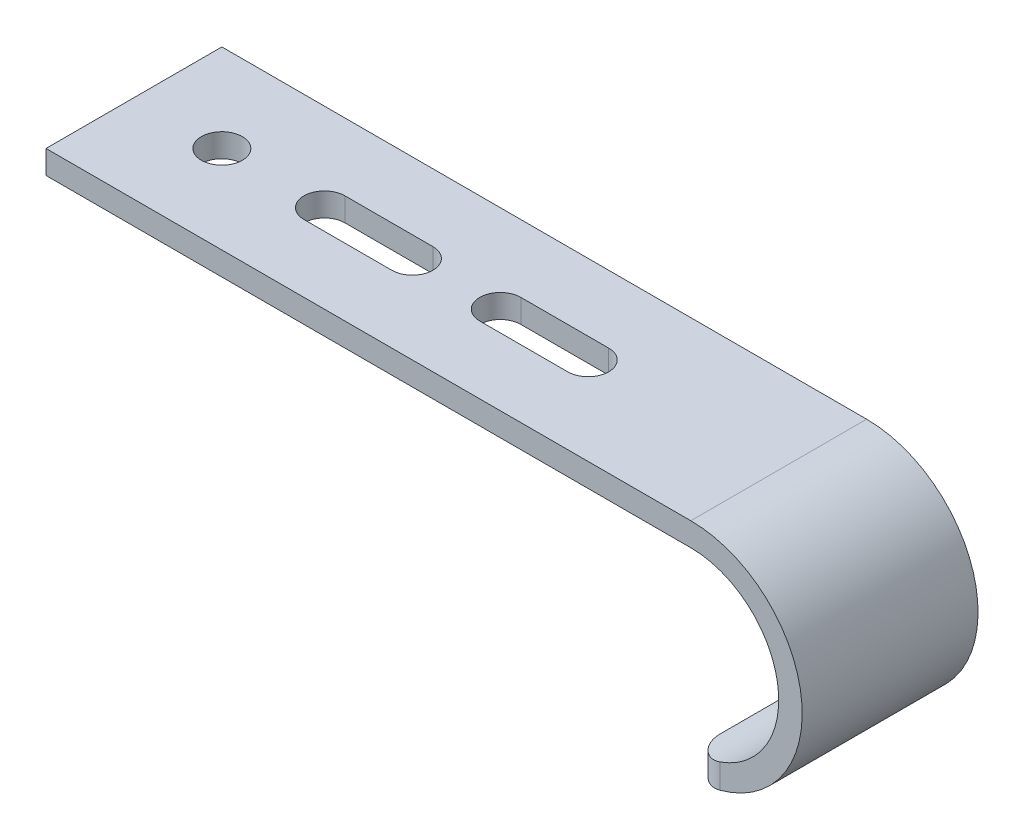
ISO-10303-21;
HEADER;
FILE_DESCRIPTION(('STEP AP214'),'2;1');
FILE_NAME('part.step','',(''),(''),'','','');
FILE_SCHEMA(('AUTOMOTIVE_DESIGN { 1 0 10303 214 1 1 1 1 }'));
ENDSEC;
DATA;
#1=APPLICATION_CONTEXT('core data for automotive mechanical design processes');
#2=APPLICATION_PROTOCOL_DEFINITION('international standard','automotive_design',2000,#1);
#3=PRODUCT_CONTEXT('',#1,'mechanical');
#4=PRODUCT('Part','Part','',(#3));
#5=PRODUCT_RELATED_PRODUCT_CATEGORY('part','',(#4));
#6=PRODUCT_DEFINITION_FORMATION('','',#4);
#7=PRODUCT_DEFINITION_CONTEXT('part definition',#1,'design');
#8=PRODUCT_DEFINITION('design','',#6,#7);
#9=PRODUCT_DEFINITION_SHAPE('','',#8);
#10=(LENGTH_UNIT() NAMED_UNIT(*) SI_UNIT(.MILLI.,.METRE.));
#11=(NAMED_UNIT(*) PLANE_ANGLE_UNIT() SI_UNIT($,.RADIAN.));
#12=(NAMED_UNIT(*) SI_UNIT($,.STERADIAN.) SOLID_ANGLE_UNIT());
#13=UNCERTAINTY_MEASURE_WITH_UNIT(LENGTH_MEASURE(1.E-05),#10,'distance_accuracy_value','');
#14=(GEOMETRIC_REPRESENTATION_CONTEXT(3) GLOBAL_UNCERTAINTY_ASSIGNED_CONTEXT((#13)) GLOBAL_UNIT_ASSIGNED_CONTEXT((#10,
#11,#12)) REPRESENTATION_CONTEXT('',''));
#15=CARTESIAN_POINT('',(0.,0.,0.));
#16=DIRECTION('',(0.,0.,1.));
#17=DIRECTION('',(1.,0.,0.));
#18=AXIS2_PLACEMENT_3D('',#15,#16,#17);
#19=CARTESIAN_POINT('',(0.,0.,15.));
#20=DIRECTION('',(0.,0.,-1.));
#21=DIRECTION('',(-1.,0.,0.));
#22=AXIS2_PLACEMENT_3D('',#19,#20,#21);
#23=CYLINDRICAL_SURFACE('',#22,15.);
#24=CARTESIAN_POINT('',(0.,-15.,-10.));
#25=CARTESIAN_POINT('',(-1.50557723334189E-05,-14.9999851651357,-10.140475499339));
#26=CARTESIAN_POINT('',(0.00591937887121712,-14.9999995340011,-10.2809488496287));
#27=CARTESIAN_POINT('',(0.0295785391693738,-14.999979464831,-10.5608933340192));
#28=CARTESIAN_POINT('',(0.0473027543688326,-14.9999450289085,-10.7003645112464));
#29=CARTESIAN_POINT('',(0.0944196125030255,-14.9997202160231,-10.9772415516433));
#30=CARTESIAN_POINT('',(0.123805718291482,-14.9995299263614,-11.1146485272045));
#31=CARTESIAN_POINT('',(0.194032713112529,-14.9987863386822,-11.3865006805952));
#32=CARTESIAN_POINT('',(0.23487346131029,-14.9982330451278,-11.5209458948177));
#33=CARTESIAN_POINT('',(0.327737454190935,-14.9964909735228,-11.7859691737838));
#34=CARTESIAN_POINT('',(0.379764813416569,-14.995301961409,-11.9165457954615));
#35=CARTESIAN_POINT('',(0.494640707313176,-14.9919522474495,-12.1728949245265));
#36=CARTESIAN_POINT('',(0.557493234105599,-14.9897911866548,-12.2986656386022));
#37=CARTESIAN_POINT('',(0.693514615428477,-14.9841137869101,-12.5443846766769));
#38=CARTESIAN_POINT('',(0.766678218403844,-14.9805981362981,-12.6643359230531));
#39=CARTESIAN_POINT('',(0.922831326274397,-14.9717900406,-12.8976554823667));
#40=CARTESIAN_POINT('',(1.00582419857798,-14.9664969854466,-13.0110215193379));
#41=CARTESIAN_POINT('',(1.18056744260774,-14.9537251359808,-13.2297736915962));
#42=CARTESIAN_POINT('',(1.27227417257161,-14.9462568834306,-13.3351952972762));
#43=CARTESIAN_POINT('',(1.46406398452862,-14.9286900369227,-13.5378838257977));
#44=CARTESIAN_POINT('',(1.56414690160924,-14.9185914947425,-13.6351509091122));
#45=CARTESIAN_POINT('',(1.77188640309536,-14.8953462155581,-13.8208230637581));
#46=CARTESIAN_POINT('',(1.87954266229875,-14.8821996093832,-13.9092285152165));
#47=CARTESIAN_POINT('',(2.10150580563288,-14.8524813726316,-14.0765226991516));
#48=CARTESIAN_POINT('',(2.21581018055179,-14.835911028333,-14.1554149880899));
#49=CARTESIAN_POINT('',(2.4479722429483,-14.7993574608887,-14.3018179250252));
#50=CARTESIAN_POINT('',(2.56572501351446,-14.7794430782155,-14.3695121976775));
#51=CARTESIAN_POINT('',(2.80572920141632,-14.7357645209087,-14.4948300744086));
#52=CARTESIAN_POINT('',(2.92797896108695,-14.7120017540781,-14.5524573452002));
#53=CARTESIAN_POINT('',(3.17606717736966,-14.6604448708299,-14.6574038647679));
#54=CARTESIAN_POINT('',(3.30190705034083,-14.6326491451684,-14.7047189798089));
#55=CARTESIAN_POINT('',(3.55605239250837,-14.5729734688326,-14.7888357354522));
#56=CARTESIAN_POINT('',(3.68435746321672,-14.5410941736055,-14.8256390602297));
#57=CARTESIAN_POINT('',(4.01013574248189,-14.4554497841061,-14.9052102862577));
#58=CARTESIAN_POINT('',(4.2086597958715,-14.3989634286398,-14.941016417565));
#59=CARTESIAN_POINT('',(4.50616131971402,-14.3075265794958,-14.9765565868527));
#60=CARTESIAN_POINT('',(4.60521253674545,-14.275953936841,-14.9853753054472));
#61=CARTESIAN_POINT('',(4.80295501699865,-14.2106461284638,-14.9970960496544));
#62=CARTESIAN_POINT('',(4.90164627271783,-14.1769109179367,-14.9999979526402));
#63=CARTESIAN_POINT('',(4.99999999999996,-14.142135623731,-15.));
#64=B_SPLINE_CURVE_WITH_KNOTS('',3,(#24,#25,#26,#27,#28,#29,#30,#31,#32,#33,#34,#35,#36,#37,#38,
#39,#40,#41,#42,#43,#44,#45,#46,#47,#48,#49,#50,#51,#52,#53,#54,#55,#56,#57,#58,#59,#60,#61,#62,
#63),.UNSPECIFIED.,.F.,.F.,(4,2,2,2,2,2,2,2,2,2,2,2,2,2,2,2,2,2,2,4),(0.,0.421298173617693,
0.842578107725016,1.26362222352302,1.68466116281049,2.10585522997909,2.52720495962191,
2.94834086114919,3.36962145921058,3.7888934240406,4.20815713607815,4.62740285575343,
5.04649135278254,5.45782348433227,5.86900548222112,6.28035200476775,6.69163258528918,
7.31819571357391,7.63104404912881,7.94389886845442),.UNSPECIFIED.);
#65=CARTESIAN_POINT('',(0.,-15.,-10.));
#66=VERTEX_POINT('',#65);
#67=CARTESIAN_POINT('',(4.99999999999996,-14.142135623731,-15.));
#68=VERTEX_POINT('',#67);
#69=EDGE_CURVE('E28',#66,#68,#64,.T.);
#70=ORIENTED_EDGE('',*,*,#69,.F.);
#71=DIRECTION('',(0.,0.,1.));
#72=VECTOR('',#71,1.);
#73=CARTESIAN_POINT('',(0.,-15.,14.9999999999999));
#74=LINE('',#73,#72);
#75=CARTESIAN_POINT('',(0.,-15.,10.0000000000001));
#76=VERTEX_POINT('',#75);
#77=EDGE_CURVE('E141',#76,#66,#74,.F.);
#78=ORIENTED_EDGE('',*,*,#77,.F.);
#79=CARTESIAN_POINT('',(5.00000000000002,-14.142135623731,15.));
#80=CARTESIAN_POINT('',(4.86810448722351,-14.1887864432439,15.0000160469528));
#81=CARTESIAN_POINT('',(4.7355252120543,-14.2335662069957,14.9947811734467));
#82=CARTESIAN_POINT('',(4.46991285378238,-14.3191904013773,14.9736024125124));
#83=CARTESIAN_POINT('',(4.33687965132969,-14.3600336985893,14.9576554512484));
#84=CARTESIAN_POINT('',(4.07133630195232,-14.4375687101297,14.9148428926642));
#85=CARTESIAN_POINT('',(3.93882621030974,-14.4742599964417,14.8879761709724));
#86=CARTESIAN_POINT('',(3.67540012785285,-14.5433821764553,14.8232587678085));
#87=CARTESIAN_POINT('',(3.54448394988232,-14.5758135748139,14.7854093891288));
#88=CARTESIAN_POINT('',(3.2850367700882,-14.6364723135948,14.6986857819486));
#89=CARTESIAN_POINT('',(3.1565112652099,-14.6646908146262,14.6497888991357));
#90=CARTESIAN_POINT('',(2.90317267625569,-14.7169400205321,14.5411800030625));
#91=CARTESIAN_POINT('',(2.77836100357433,-14.7409691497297,14.4814639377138));
#92=CARTESIAN_POINT('',(2.53371666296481,-14.7849826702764,14.3516207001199));
#93=CARTESIAN_POINT('',(2.41387854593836,-14.8049715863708,14.2815053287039));
#94=CARTESIAN_POINT('',(2.18001781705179,-14.8412105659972,14.1312257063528));
#95=CARTESIAN_POINT('',(2.06599736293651,-14.8574592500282,14.0510577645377));
#96=CARTESIAN_POINT('',(1.84791998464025,-14.8861326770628,13.8836516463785));
#97=CARTESIAN_POINT('',(1.74367235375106,-14.8986526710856,13.7966779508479));
#98=CARTESIAN_POINT('',(1.54239889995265,-14.9208331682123,13.6143382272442));
#99=CARTESIAN_POINT('',(1.44537570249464,-14.9304926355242,13.5189691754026));
#100=CARTESIAN_POINT('',(1.25932691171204,-14.9473349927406,13.3205217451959));
#101=CARTESIAN_POINT('',(1.1703014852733,-14.9545178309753,13.2174432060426));
#102=CARTESIAN_POINT('',(1.00087326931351,-14.9668123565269,13.0042523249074));
#103=CARTESIAN_POINT('',(0.920473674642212,-14.9719232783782,12.894137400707));
#104=CARTESIAN_POINT('',(0.768136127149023,-14.98051564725,12.6665095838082));
#105=CARTESIAN_POINT('',(0.696292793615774,-14.9839799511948,12.5489327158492));
#106=CARTESIAN_POINT('',(0.562516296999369,-14.989598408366,12.3081838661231));
#107=CARTESIAN_POINT('',(0.500587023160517,-14.991752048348,12.1850097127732));
#108=CARTESIAN_POINT('',(0.387141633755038,-14.9951107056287,11.9340327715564));
#109=CARTESIAN_POINT('',(0.33561874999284,-14.9963163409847,11.8062330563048));
#110=CARTESIAN_POINT('',(0.243282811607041,-14.9980976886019,11.5468109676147));
#111=CARTESIAN_POINT('',(0.202472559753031,-14.9986732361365,11.4151876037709));
#112=CARTESIAN_POINT('',(0.111746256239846,-14.999688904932,11.0731310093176));
#113=CARTESIAN_POINT('',(0.0698676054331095,-14.9998655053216,10.8604805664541));
#114=CARTESIAN_POINT('',(0.0279667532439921,-14.9999793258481,10.5390645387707));
#115=CARTESIAN_POINT('',(0.017485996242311,-14.9999920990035,10.4315416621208));
#116=CARTESIAN_POINT('',(0.00350320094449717,-15.0000005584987,10.2160256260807));
#117=CARTESIAN_POINT('',(2.28500579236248E-06,-14.9999962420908,10.108032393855));
#118=CARTESIAN_POINT('',(0.,-15.,10.0000000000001));
#119=B_SPLINE_CURVE_WITH_KNOTS('',3,(#79,#80,#81,#82,#83,#84,#85,#86,#87,#88,#89,#90,#91,#92,
#93,#94,#95,#96,#97,#98,#99,#100,#101,#102,#103,#104,#105,#106,#107,#108,#109,#110,#111,#112,
#113,#114,#115,#116,#117,#118),.UNSPECIFIED.,.F.,.F.,(4,2,2,2,2,2,2,2,2,2,2,2,2,2,2,2,2,2,2,4),
(0.,0.419626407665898,0.839373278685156,1.25916338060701,1.67890370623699,2.09951270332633,
2.52027955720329,2.94057253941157,3.36102028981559,3.7695625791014,4.17825262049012,
4.58695118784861,4.9958006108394,5.40881810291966,5.82199722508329,6.2349067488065,
6.64792419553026,7.29601308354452,7.61992335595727,7.94388570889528),.UNSPECIFIED.);
#120=CARTESIAN_POINT('',(5.00000000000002,-14.142135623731,15.));
#121=VERTEX_POINT('',#120);
#122=EDGE_CURVE('E162',#121,#76,#119,.T.);
#123=ORIENTED_EDGE('',*,*,#122,.F.);
#124=CARTESIAN_POINT('',(0.,0.,15.));
#125=DIRECTION('',(0.,0.,-1.));
#126=DIRECTION('',(-1.,0.,0.));
#127=AXIS2_PLACEMENT_3D('',#124,#125,#126);
#128=CIRCLE('',#127,15.);
#129=CARTESIAN_POINT('',(0.,15.,14.9999999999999));
#130=VERTEX_POINT('',#129);
#131=EDGE_CURVE('E165',#130,#121,#128,.T.);
#132=ORIENTED_EDGE('',*,*,#131,.F.);
#133=DIRECTION('',(0.,0.,1.));
#134=VECTOR('',#133,1.);
#135=CARTESIAN_POINT('',(0.,15.,14.9999999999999));
#136=LINE('',#135,#134);
#137=CARTESIAN_POINT('',(0.,15.,-15.));
#138=VERTEX_POINT('',#137);
#139=EDGE_CURVE('E235',#138,#130,#136,.T.);
#140=ORIENTED_EDGE('',*,*,#139,.F.);
#141=CARTESIAN_POINT('',(0.,0.,-15.));
#142=DIRECTION('',(0.,0.,-1.));
#143=DIRECTION('',(-1.,0.,0.));
#144=AXIS2_PLACEMENT_3D('',#141,#142,#143);
#145=CIRCLE('',#144,15.);
#146=EDGE_CURVE('E161',#68,#138,#145,.F.);
#147=ORIENTED_EDGE('',*,*,#146,.F.);
#148=EDGE_LOOP('',(#70,#78,#123,#132,#140,#147));
#149=FACE_BOUND('',#148,.T.);
#150=ADVANCED_FACE('F24',(#149),#23,.F.);
#151=CARTESIAN_POINT('',(0.,-19.,15.));
#152=DIRECTION('',(-1.,0.,0.));
#153=DIRECTION('',(0.,-1.,0.));
#154=AXIS2_PLACEMENT_3D('',#151,#152,#153);
#155=PLANE('',#154);
#156=DIRECTION('',(0.,0.,-1.));
#157=VECTOR('',#156,1.);
#158=CARTESIAN_POINT('',(0.,-19.,15.));
#159=LINE('',#158,#157);
#160=CARTESIAN_POINT('',(0.,-19.,10.));
#161=VERTEX_POINT('',#160);
#162=CARTESIAN_POINT('',(0.,-19.,-10.));
#163=VERTEX_POINT('',#162);
#164=EDGE_CURVE('E215',#161,#163,#159,.T.);
#165=ORIENTED_EDGE('',*,*,#164,.F.);
#166=DIRECTION('',(0.,1.,0.));
#167=VECTOR('',#166,1.);
#168=CARTESIAN_POINT('',(0.,-19.,10.));
#169=LINE('',#168,#167);
#170=EDGE_CURVE('E147',#76,#161,#169,.F.);
#171=ORIENTED_EDGE('',*,*,#170,.F.);
#172=ORIENTED_EDGE('',*,*,#77,.T.);
#173=DIRECTION('',(0.,1.,0.));
#174=VECTOR('',#173,1.);
#175=CARTESIAN_POINT('',(0.,19.,-10.));
#176=LINE('',#175,#174);
#177=EDGE_CURVE('E145',#163,#66,#176,.T.);
#178=ORIENTED_EDGE('',*,*,#177,.F.);
#179=EDGE_LOOP('',(#165,#171,#172,#178));
#180=FACE_BOUND('',#179,.T.);
#181=ADVANCED_FACE('F144',(#180),#155,.T.);
#182=CARTESIAN_POINT('',(5.,19.,-9.99999999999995));
#183=DIRECTION('',(0.,1.,0.));
#184=DIRECTION('',(-1.,0.,0.));
#185=AXIS2_PLACEMENT_3D('',#182,#183,#184);
#186=CYLINDRICAL_SURFACE('',#185,5.);
#187=ORIENTED_EDGE('',*,*,#69,.T.);
#188=DIRECTION('',(0.,1.,0.));
#189=VECTOR('',#188,1.);
#190=CARTESIAN_POINT('',(5.00000000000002,19.,-15.));
#191=LINE('',#190,#189);
#192=CARTESIAN_POINT('',(5.00000000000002,-18.3303027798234,-15.));
#193=VERTEX_POINT('',#192);
#194=EDGE_CURVE('E234',#193,#68,#191,.T.);
#195=ORIENTED_EDGE('',*,*,#194,.F.);
#196=CARTESIAN_POINT('',(0.,-19.,-10.));
#197=CARTESIAN_POINT('',(-1.50808625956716E-05,-18.9999882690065,-10.1405338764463));
#198=CARTESIAN_POINT('',(0.00592429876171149,-18.9999996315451,-10.2810655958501));
#199=CARTESIAN_POINT('',(0.0296030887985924,-18.9999837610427,-10.5611253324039));
#200=CARTESIAN_POINT('',(0.0473419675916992,-18.9999565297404,-10.7006533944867));
#201=CARTESIAN_POINT('',(0.0944959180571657,-18.9997787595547,-10.9776313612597));
#202=CARTESIAN_POINT('',(0.123903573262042,-18.9996282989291,-11.1150825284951));
#203=CARTESIAN_POINT('',(0.194181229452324,-18.9990403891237,-11.387020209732));
#204=CARTESIAN_POINT('',(0.235051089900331,-18.9986029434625,-11.5215067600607));
#205=CARTESIAN_POINT('',(0.327979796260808,-18.9972257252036,-11.7866065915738));
#206=CARTESIAN_POINT('',(0.380042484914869,-18.9962857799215,-11.9172185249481));
#207=CARTESIAN_POINT('',(0.494997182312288,-18.993637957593,-12.1736370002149));
#208=CARTESIAN_POINT('',(0.557893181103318,-18.9919297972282,-12.2994417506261));
#209=CARTESIAN_POINT('',(0.694012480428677,-18.9874426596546,-12.5452301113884));
#210=CARTESIAN_POINT('',(0.76723043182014,-18.9846642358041,-12.665216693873));
#211=CARTESIAN_POINT('',(0.923511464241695,-18.9777038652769,-12.8986155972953));
#212=CARTESIAN_POINT('',(1.00657793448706,-18.9735214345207,-13.0120256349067));
#213=CARTESIAN_POINT('',(1.18165235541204,-18.9634216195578,-13.2310708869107));
#214=CARTESIAN_POINT('',(1.27363225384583,-18.9575095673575,-13.336728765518));
#215=CARTESIAN_POINT('',(1.46605376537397,-18.943600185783,-13.5398867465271));
#216=CARTESIAN_POINT('',(1.56649527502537,-18.9356028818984,-13.6373869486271));
#217=CARTESIAN_POINT('',(1.77508302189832,-18.9171890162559,-13.8235392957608));
#218=CARTESIAN_POINT('',(1.88323009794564,-18.9067721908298,-13.9121904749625));
#219=CARTESIAN_POINT('',(2.10633425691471,-18.8832182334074,-14.079972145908));
#220=CARTESIAN_POINT('',(2.2212888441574,-18.8700820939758,-14.159106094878));
#221=CARTESIAN_POINT('',(2.45577751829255,-18.8409912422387,-14.3064937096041));
#222=CARTESIAN_POINT('',(2.5752439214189,-18.8250706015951,-14.3748618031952));
#223=CARTESIAN_POINT('',(2.81899406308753,-18.7901151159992,-14.5013398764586));
#224=CARTESIAN_POINT('',(2.94327603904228,-18.7710814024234,-14.5594535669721));
#225=CARTESIAN_POINT('',(3.19575052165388,-18.7297499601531,-14.6651268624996));
#226=CARTESIAN_POINT('',(3.32394359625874,-18.7074517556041,-14.7126849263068));
#227=CARTESIAN_POINT('',(3.58317428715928,-18.6595353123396,-14.7969985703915));
#228=CARTESIAN_POINT('',(3.71421136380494,-18.633917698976,-14.8337561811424));
#229=CARTESIAN_POINT('',(4.03665731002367,-18.5672586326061,-14.9102149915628));
#230=CARTESIAN_POINT('',(4.22913664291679,-18.524406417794,-14.9440287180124));
#231=CARTESIAN_POINT('',(4.51833048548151,-18.4552038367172,-14.9776927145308));
#232=CARTESIAN_POINT('',(4.61474405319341,-18.4313329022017,-14.9860713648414));
#233=CARTESIAN_POINT('',(4.8074991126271,-18.3819980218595,-14.9972245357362));
#234=CARTESIAN_POINT('',(4.9038405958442,-18.3565339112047,-14.999998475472));
#235=CARTESIAN_POINT('',(5.00000000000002,-18.3303027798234,-15.));
#236=B_SPLINE_CURVE_WITH_KNOTS('',3,(#196,#197,#198,#199,#200,#201,#202,#203,#204,#205,#206,
#207,#208,#209,#210,#211,#212,#213,#214,#215,#216,#217,#218,#219,#220,#221,#222,#223,#224,#225,
#226,#227,#228,#229,#230,#231,#232,#233,#234,#235),.UNSPECIFIED.,.F.,.F.,(4,2,2,2,2,2,2,2,2,2,2,
2,2,2,2,2,2,2,2,4),(0.,0.421473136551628,0.842927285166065,1.26411399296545,1.68529553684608,
2.10662191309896,2.52810380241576,2.94936806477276,3.37077772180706,3.79090172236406,
4.21102058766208,4.63118525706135,5.05119683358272,5.46638893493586,5.88143047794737,
6.29653258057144,6.71155659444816,7.31012548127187,7.60901730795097,7.90794010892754),.UNSPECIFIED.);
#237=EDGE_CURVE('E157',#163,#193,#236,.T.);
#238=ORIENTED_EDGE('',*,*,#237,.F.);
#239=ORIENTED_EDGE('',*,*,#177,.T.);
#240=EDGE_LOOP('',(#187,#195,#238,#239));
#241=FACE_BOUND('',#240,.T.);
#242=ADVANCED_FACE('F154',(#241),#186,.T.);
#243=CARTESIAN_POINT('',(4.99999999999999,-19.,9.99999999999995));
#244=DIRECTION('',(0.,1.,0.));
#245=DIRECTION('',(-1.,0.,0.));
#246=AXIS2_PLACEMENT_3D('',#243,#244,#245);
#247=CYLINDRICAL_SURFACE('',#246,5.);
#248=ORIENTED_EDGE('',*,*,#122,.T.);
#249=ORIENTED_EDGE('',*,*,#170,.T.);
#250=CARTESIAN_POINT('',(5.00000000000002,-18.3303027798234,15.));
#251=CARTESIAN_POINT('',(4.86477380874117,-18.3672038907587,15.0000159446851));
#252=CARTESIAN_POINT('',(4.72911916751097,-18.402584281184,14.9945144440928));
#253=CARTESIAN_POINT('',(4.45790002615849,-18.4701519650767,14.9723838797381));
#254=CARTESIAN_POINT('',(4.32233554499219,-18.5023387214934,14.9557529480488));
#255=CARTESIAN_POINT('',(4.05232165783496,-18.5633477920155,14.9112760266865));
#256=CARTESIAN_POINT('',(3.91787199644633,-18.5921708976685,14.8834326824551));
#257=CARTESIAN_POINT('',(3.65108779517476,-18.6463957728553,14.8165695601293));
#258=CARTESIAN_POINT('',(3.51875308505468,-18.6717978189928,14.7775506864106));
#259=CARTESIAN_POINT('',(3.25703556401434,-18.7192263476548,14.6884126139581));
#260=CARTESIAN_POINT('',(3.12765723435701,-18.7412479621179,14.6382776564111));
#261=CARTESIAN_POINT('',(2.8730360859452,-18.7819672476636,14.5271762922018));
#262=CARTESIAN_POINT('',(2.7477948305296,-18.8006636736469,14.4662058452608));
#263=CARTESIAN_POINT('',(2.50262001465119,-18.8348666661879,14.3338760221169));
#264=CARTESIAN_POINT('',(2.38268175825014,-18.850376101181,14.2625260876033));
#265=CARTESIAN_POINT('',(2.14891148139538,-18.8784545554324,14.1098408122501));
#266=CARTESIAN_POINT('',(2.0350817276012,-18.8910224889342,14.0285018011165));
#267=CARTESIAN_POINT('',(1.81647773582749,-18.9132827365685,13.8579857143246));
#268=CARTESIAN_POINT('',(1.71157693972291,-18.9230229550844,13.7689770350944));
#269=CARTESIAN_POINT('',(1.50933241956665,-18.9402276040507,13.5824806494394));
#270=CARTESIAN_POINT('',(1.41199147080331,-18.9476912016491,13.4849898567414));
#271=CARTESIAN_POINT('',(1.22563358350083,-18.9606579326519,13.2822426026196));
#272=CARTESIAN_POINT('',(1.13661624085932,-18.9661611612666,13.1769865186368));
#273=CARTESIAN_POINT('',(0.967513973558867,-18.9755393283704,12.9594000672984));
#274=CARTESIAN_POINT('',(0.88743232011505,-18.9794136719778,12.8470671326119));
#275=CARTESIAN_POINT('',(0.736293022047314,-18.9858799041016,12.6153520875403));
#276=CARTESIAN_POINT('',(0.665300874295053,-18.9884628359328,12.4959270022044));
#277=CARTESIAN_POINT('',(0.533466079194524,-18.9926240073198,12.2515246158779));
#278=CARTESIAN_POINT('',(0.472627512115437,-18.9942018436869,12.1265451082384));
#279=CARTESIAN_POINT('',(0.361602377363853,-18.9966399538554,11.8720369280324));
#280=CARTESIAN_POINT('',(0.311408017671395,-18.9975007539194,11.7425116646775));
#281=CARTESIAN_POINT('',(0.22195811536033,-18.9987559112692,11.4797302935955));
#282=CARTESIAN_POINT('',(0.182705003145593,-18.9991501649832,11.3464733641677));
#283=CARTESIAN_POINT('',(0.0996070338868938,-18.9998049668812,11.013771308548));
#284=CARTESIAN_POINT('',(0.0622686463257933,-18.9999156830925,10.8126424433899));
#285=CARTESIAN_POINT('',(0.0249203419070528,-18.9999870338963,10.5089261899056));
#286=CARTESIAN_POINT('',(0.0155807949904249,-18.9999950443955,10.4073872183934));
#287=CARTESIAN_POINT('',(0.00312088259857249,-19.0000003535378,10.203909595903));
#288=CARTESIAN_POINT('',(1.66103158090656E-06,-18.9999976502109,10.1019708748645));
#289=CARTESIAN_POINT('',(0.,-19.,10.));
#290=B_SPLINE_CURVE_WITH_KNOTS('',3,(#250,#251,#252,#253,#254,#255,#256,#257,#258,#259,#260,
#261,#262,#263,#264,#265,#266,#267,#268,#269,#270,#271,#272,#273,#274,#275,#276,#277,#278,#279,
#280,#281,#282,#283,#284,#285,#286,#287,#288,#289),.UNSPECIFIED.,.F.,.F.,(4,2,2,2,2,2,2,2,2,2,2,
2,2,2,2,2,2,2,2,4),(0.,0.420414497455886,0.840899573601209,1.26128549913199,1.68163741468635,
2.10258909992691,2.52369807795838,2.94442636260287,3.36530970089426,3.77857973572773,
4.19200077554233,4.60540173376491,5.01895353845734,5.43533509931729,5.85188358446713,
6.26812607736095,6.68446095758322,7.29639043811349,7.60213499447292,7.90793577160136),.UNSPECIFIED.);
#291=CARTESIAN_POINT('',(5.00000000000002,-18.3303027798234,15.));
#292=VERTEX_POINT('',#291);
#293=EDGE_CURVE('E183',#292,#161,#290,.T.);
#294=ORIENTED_EDGE('',*,*,#293,.F.);
#295=DIRECTION('',(0.,1.,0.));
#296=VECTOR('',#295,1.);
#297=CARTESIAN_POINT('',(5.,15.,15.));
#298=LINE('',#297,#296);
#299=EDGE_CURVE('E238',#121,#292,#298,.F.);
#300=ORIENTED_EDGE('',*,*,#299,.F.);
#301=EDGE_LOOP('',(#248,#249,#294,#300));
#302=FACE_BOUND('',#301,.T.);
#303=ADVANCED_FACE('F174',(#302),#247,.T.);
#304=CARTESIAN_POINT('',(0.,15.,14.9999999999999));
#305=DIRECTION('',(0.,-1.,0.));
#306=DIRECTION('',(1.,0.,0.));
#307=AXIS2_PLACEMENT_3D('',#304,#305,#306);
#308=PLANE('',#307);
#309=DIRECTION('',(1.,0.,0.));
#310=VECTOR('',#309,1.);
#311=CARTESIAN_POINT('',(0.,15.,14.9999999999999));
#312=LINE('',#311,#310);
#313=CARTESIAN_POINT('',(-110.,15.,15.));
#314=VERTEX_POINT('',#313);
#315=EDGE_CURVE('E192',#314,#130,#312,.T.);
#316=ORIENTED_EDGE('',*,*,#315,.F.);
#317=DIRECTION('',(0.,0.,1.));
#318=VECTOR('',#317,1.);
#319=CARTESIAN_POINT('',(-110.,15.,15.));
#320=LINE('',#319,#318);
#321=CARTESIAN_POINT('',(-110.,15.,-14.9999999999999));
#322=VERTEX_POINT('',#321);
#323=EDGE_CURVE('E259',#322,#314,#320,.T.);
#324=ORIENTED_EDGE('',*,*,#323,.F.);
#325=DIRECTION('',(1.,0.,0.));
#326=VECTOR('',#325,1.);
#327=CARTESIAN_POINT('',(0.,15.,-15.));
#328=LINE('',#327,#326);
#329=EDGE_CURVE('E243',#322,#138,#328,.T.);
#330=ORIENTED_EDGE('',*,*,#329,.T.);
#331=ORIENTED_EDGE('',*,*,#139,.T.);
#332=EDGE_LOOP('',(#316,#324,#330,#331));
#333=FACE_BOUND('',#332,.T.);
#334=CARTESIAN_POINT('',(-95.,15.,-1.11022302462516E-13));
#335=DIRECTION('',(0.,1.,0.));
#336=DIRECTION('',(-1.,0.,0.));
#337=AXIS2_PLACEMENT_3D('',#334,#335,#336);
#338=CIRCLE('',#337,3.5);
#339=CARTESIAN_POINT('',(-98.5,15.,-1.10988909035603E-13));
#340=VERTEX_POINT('',#339);
#341=EDGE_CURVE('E216',#340,#340,#338,.T.);
#342=ORIENTED_EDGE('',*,*,#341,.T.);
#343=EDGE_LOOP('',(#342));
#344=FACE_BOUND('',#343,.T.);
#345=DIRECTION('',(-1.,0.,0.));
#346=VECTOR('',#345,1.);
#347=CARTESIAN_POINT('',(-47.5,15.,-3.5));
#348=LINE('',#347,#346);
#349=CARTESIAN_POINT('',(-32.5,15.,-3.5));
#350=VERTEX_POINT('',#349);
#351=CARTESIAN_POINT('',(-47.5,15.,-3.5));
#352=VERTEX_POINT('',#351);
#353=EDGE_CURVE('E280',#350,#352,#348,.T.);
#354=ORIENTED_EDGE('',*,*,#353,.T.);
#355=CARTESIAN_POINT('',(-47.5,15.,0.));
#356=DIRECTION('',(0.,1.,0.));
#357=DIRECTION('',(-1.,0.,0.));
#358=AXIS2_PLACEMENT_3D('',#355,#356,#357);
#359=CIRCLE('',#358,3.5);
#360=CARTESIAN_POINT('',(-47.5,15.,3.5));
#361=VERTEX_POINT('',#360);
#362=EDGE_CURVE('E220',#352,#361,#359,.T.);
#363=ORIENTED_EDGE('',*,*,#362,.T.);
#364=DIRECTION('',(1.,0.,0.));
#365=VECTOR('',#364,1.);
#366=CARTESIAN_POINT('',(-47.5,15.,3.5));
#367=LINE('',#366,#365);
#368=CARTESIAN_POINT('',(-32.5,15.,3.5));
#369=VERTEX_POINT('',#368);
#370=EDGE_CURVE('E219',#361,#369,#367,.T.);
#371=ORIENTED_EDGE('',*,*,#370,.T.);
#372=CARTESIAN_POINT('',(-32.5,15.,0.));
#373=DIRECTION('',(0.,1.,0.));
#374=DIRECTION('',(-1.,0.,0.));
#375=AXIS2_PLACEMENT_3D('',#372,#373,#374);
#376=CIRCLE('',#375,3.5);
#377=EDGE_CURVE('E224',#369,#350,#376,.T.);
#378=ORIENTED_EDGE('',*,*,#377,.T.);
#379=EDGE_LOOP('',(#354,#363,#371,#378));
#380=FACE_BOUND('',#379,.T.);
#381=DIRECTION('',(-1.,0.,0.));
#382=VECTOR('',#381,1.);
#383=CARTESIAN_POINT('',(-77.5,15.,-3.49999999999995));
#384=LINE('',#383,#382);
#385=CARTESIAN_POINT('',(-62.5,15.,-3.50000000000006));
#386=VERTEX_POINT('',#385);
#387=CARTESIAN_POINT('',(-77.5,15.,-3.49999999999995));
#388=VERTEX_POINT('',#387);
#389=EDGE_CURVE('E286',#386,#388,#384,.T.);
#390=ORIENTED_EDGE('',*,*,#389,.T.);
#391=CARTESIAN_POINT('',(-77.5,15.,0.));
#392=DIRECTION('',(0.,1.,0.));
#393=DIRECTION('',(-1.,0.,0.));
#394=AXIS2_PLACEMENT_3D('',#391,#392,#393);
#395=CIRCLE('',#394,3.5);
#396=CARTESIAN_POINT('',(-77.5,15.,3.5));
#397=VERTEX_POINT('',#396);
#398=EDGE_CURVE('E228',#388,#397,#395,.T.);
#399=ORIENTED_EDGE('',*,*,#398,.T.);
#400=DIRECTION('',(1.,0.,0.));
#401=VECTOR('',#400,1.);
#402=CARTESIAN_POINT('',(-77.5,15.,3.5));
#403=LINE('',#402,#401);
#404=CARTESIAN_POINT('',(-62.5,15.,3.5));
#405=VERTEX_POINT('',#404);
#406=EDGE_CURVE('E227',#397,#405,#403,.T.);
#407=ORIENTED_EDGE('',*,*,#406,.T.);
#408=CARTESIAN_POINT('',(-62.5,15.,0.));
#409=DIRECTION('',(0.,1.,0.));
#410=DIRECTION('',(-1.,0.,0.));
#411=AXIS2_PLACEMENT_3D('',#408,#409,#410);
#412=CIRCLE('',#411,3.5);
#413=EDGE_CURVE('E232',#405,#386,#412,.T.);
#414=ORIENTED_EDGE('',*,*,#413,.T.);
#415=EDGE_LOOP('',(#390,#399,#407,#414));
#416=FACE_BOUND('',#415,.T.);
#417=ADVANCED_FACE('F178',(#333,#344,#380,#416),#308,.T.);
#418=CARTESIAN_POINT('',(-62.5,8.99999999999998,0.));
#419=DIRECTION('',(0.,1.,0.));
#420=DIRECTION('',(-1.,0.,0.));
#421=AXIS2_PLACEMENT_3D('',#418,#419,#420);
#422=CYLINDRICAL_SURFACE('',#421,3.5);
#423=DIRECTION('',(0.,1.,0.));
#424=VECTOR('',#423,1.);
#425=CARTESIAN_POINT('',(-62.5,8.99999999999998,3.50000000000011));
#426=LINE('',#425,#424);
#427=CARTESIAN_POINT('',(-62.5000000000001,19.,3.50000000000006));
#428=VERTEX_POINT('',#427);
#429=EDGE_CURVE('E230',#405,#428,#426,.T.);
#430=ORIENTED_EDGE('',*,*,#429,.T.);
#431=CARTESIAN_POINT('',(-62.5,19.,0.));
#432=DIRECTION('',(0.,1.,0.));
#433=DIRECTION('',(-1.,0.,0.));
#434=AXIS2_PLACEMENT_3D('',#431,#432,#433);
#435=CIRCLE('',#434,3.5);
#436=CARTESIAN_POINT('',(-62.5,19.,-3.50000000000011));
#437=VERTEX_POINT('',#436);
#438=EDGE_CURVE('E194',#428,#437,#435,.T.);
#439=ORIENTED_EDGE('',*,*,#438,.T.);
#440=DIRECTION('',(0.,1.,0.));
#441=VECTOR('',#440,1.);
#442=CARTESIAN_POINT('',(-62.5,9.00000000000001,-3.50000000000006));
#443=LINE('',#442,#441);
#444=EDGE_CURVE('E233',#437,#386,#443,.F.);
#445=ORIENTED_EDGE('',*,*,#444,.T.);
#446=ORIENTED_EDGE('',*,*,#413,.F.);
#447=EDGE_LOOP('',(#430,#439,#445,#446));
#448=FACE_BOUND('',#447,.T.);
#449=ADVANCED_FACE('F338',(#448),#422,.F.);
#450=CARTESIAN_POINT('',(-77.5,9.00000000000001,-3.5));
#451=DIRECTION('',(0.,0.,-1.));
#452=DIRECTION('',(-1.,0.,0.));
#453=AXIS2_PLACEMENT_3D('',#450,#451,#452);
#454=PLANE('',#453);
#455=ORIENTED_EDGE('',*,*,#444,.F.);
#456=DIRECTION('',(1.,0.,0.));
#457=VECTOR('',#456,1.);
#458=CARTESIAN_POINT('',(0.,19.,-3.49999999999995));
#459=LINE('',#458,#457);
#460=CARTESIAN_POINT('',(-77.5,19.,-3.49999999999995));
#461=VERTEX_POINT('',#460);
#462=EDGE_CURVE('E299',#437,#461,#459,.F.);
#463=ORIENTED_EDGE('',*,*,#462,.T.);
#464=DIRECTION('',(0.,1.,0.));
#465=VECTOR('',#464,1.);
#466=CARTESIAN_POINT('',(-77.5,9.00000000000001,-3.5));
#467=LINE('',#466,#465);
#468=EDGE_CURVE('E231',#461,#388,#467,.F.);
#469=ORIENTED_EDGE('',*,*,#468,.T.);
#470=ORIENTED_EDGE('',*,*,#389,.F.);
#471=EDGE_LOOP('',(#455,#463,#469,#470));
#472=FACE_BOUND('',#471,.T.);
#473=ADVANCED_FACE('F326',(#472),#454,.F.);
#474=CARTESIAN_POINT('',(-77.5,8.99999999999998,0.));
#475=DIRECTION('',(0.,1.,0.));
#476=DIRECTION('',(-1.,0.,0.));
#477=AXIS2_PLACEMENT_3D('',#474,#475,#476);
#478=CYLINDRICAL_SURFACE('',#477,3.5);
#479=ORIENTED_EDGE('',*,*,#398,.F.);
#480=ORIENTED_EDGE('',*,*,#468,.F.);
#481=CARTESIAN_POINT('',(-77.5000000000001,19.,0.));
#482=DIRECTION('',(0.,1.,0.));
#483=DIRECTION('',(-1.,0.,0.));
#484=AXIS2_PLACEMENT_3D('',#481,#482,#483);
#485=CIRCLE('',#484,3.5);
#486=CARTESIAN_POINT('',(-77.5,19.,3.49999999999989));
#487=VERTEX_POINT('',#486);
#488=EDGE_CURVE('E298',#461,#487,#485,.T.);
#489=ORIENTED_EDGE('',*,*,#488,.T.);
#490=DIRECTION('',(0.,1.,0.));
#491=VECTOR('',#490,1.);
#492=CARTESIAN_POINT('',(-77.5000000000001,9.00000000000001,3.49999999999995));
#493=LINE('',#492,#491);
#494=EDGE_CURVE('E285',#487,#397,#493,.F.);
#495=ORIENTED_EDGE('',*,*,#494,.T.);
#496=EDGE_LOOP('',(#479,#480,#489,#495));
#497=FACE_BOUND('',#496,.T.);
#498=ADVANCED_FACE('F328',(#497),#478,.F.);
#499=CARTESIAN_POINT('',(-77.5000000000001,9.00000000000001,3.49999999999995));
#500=DIRECTION('',(0.,0.,1.));
#501=DIRECTION('',(1.,0.,0.));
#502=AXIS2_PLACEMENT_3D('',#499,#500,#501);
#503=PLANE('',#502);
#504=ORIENTED_EDGE('',*,*,#494,.F.);
#505=DIRECTION('',(1.,0.,0.));
#506=VECTOR('',#505,1.);
#507=CARTESIAN_POINT('',(0.,19.,3.49999999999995));
#508=LINE('',#507,#506);
#509=EDGE_CURVE('E297',#487,#428,#508,.T.);
#510=ORIENTED_EDGE('',*,*,#509,.T.);
#511=ORIENTED_EDGE('',*,*,#429,.F.);
#512=ORIENTED_EDGE('',*,*,#406,.F.);
#513=EDGE_LOOP('',(#504,#510,#511,#512));
#514=FACE_BOUND('',#513,.T.);
#515=ADVANCED_FACE('F334',(#514),#503,.F.);
#516=CARTESIAN_POINT('',(-32.5,9.00000000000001,0.));
#517=DIRECTION('',(0.,1.,0.));
#518=DIRECTION('',(-1.,0.,0.));
#519=AXIS2_PLACEMENT_3D('',#516,#517,#518);
#520=CYLINDRICAL_SURFACE('',#519,3.5);
#521=DIRECTION('',(0.,1.,0.));
#522=VECTOR('',#521,1.);
#523=CARTESIAN_POINT('',(-32.5,8.99999999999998,3.5));
#524=LINE('',#523,#522);
#525=CARTESIAN_POINT('',(-32.5,19.,3.5));
#526=VERTEX_POINT('',#525);
#527=EDGE_CURVE('E222',#369,#526,#524,.T.);
#528=ORIENTED_EDGE('',*,*,#527,.T.);
#529=CARTESIAN_POINT('',(-32.5,19.,0.));
#530=DIRECTION('',(0.,1.,0.));
#531=DIRECTION('',(-1.,0.,0.));
#532=AXIS2_PLACEMENT_3D('',#529,#530,#531);
#533=CIRCLE('',#532,3.5);
#534=CARTESIAN_POINT('',(-32.5,19.,-3.49999999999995));
#535=VERTEX_POINT('',#534);
#536=EDGE_CURVE('E295',#526,#535,#533,.T.);
#537=ORIENTED_EDGE('',*,*,#536,.T.);
#538=DIRECTION('',(0.,1.,0.));
#539=VECTOR('',#538,1.);
#540=CARTESIAN_POINT('',(-32.5,9.00000000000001,-3.5));
#541=LINE('',#540,#539);
#542=EDGE_CURVE('E226',#535,#350,#541,.F.);
#543=ORIENTED_EDGE('',*,*,#542,.T.);
#544=ORIENTED_EDGE('',*,*,#377,.F.);
#545=EDGE_LOOP('',(#528,#537,#543,#544));
#546=FACE_BOUND('',#545,.T.);
#547=ADVANCED_FACE('F392',(#546),#520,.F.);
#548=CARTESIAN_POINT('',(-47.5,8.99999999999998,-3.49999999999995));
#549=DIRECTION('',(0.,0.,-1.));
#550=DIRECTION('',(-1.,0.,0.));
#551=AXIS2_PLACEMENT_3D('',#548,#549,#550);
#552=PLANE('',#551);
#553=ORIENTED_EDGE('',*,*,#542,.F.);
#554=DIRECTION('',(1.,0.,0.));
#555=VECTOR('',#554,1.);
#556=CARTESIAN_POINT('',(0.,19.,-3.49999999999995));
#557=LINE('',#556,#555);
#558=CARTESIAN_POINT('',(-47.5,19.,-3.5));
#559=VERTEX_POINT('',#558);
#560=EDGE_CURVE('E294',#535,#559,#557,.F.);
#561=ORIENTED_EDGE('',*,*,#560,.T.);
#562=DIRECTION('',(0.,1.,0.));
#563=VECTOR('',#562,1.);
#564=CARTESIAN_POINT('',(-47.5,8.99999999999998,-3.49999999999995));
#565=LINE('',#564,#563);
#566=EDGE_CURVE('E223',#559,#352,#565,.F.);
#567=ORIENTED_EDGE('',*,*,#566,.T.);
#568=ORIENTED_EDGE('',*,*,#353,.F.);
#569=EDGE_LOOP('',(#553,#561,#567,#568));
#570=FACE_BOUND('',#569,.T.);
#571=ADVANCED_FACE('F378',(#570),#552,.F.);
#572=CARTESIAN_POINT('',(-47.5,8.99999999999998,0.));
#573=DIRECTION('',(0.,1.,0.));
#574=DIRECTION('',(-1.,0.,0.));
#575=AXIS2_PLACEMENT_3D('',#572,#573,#574);
#576=CYLINDRICAL_SURFACE('',#575,3.5);
#577=ORIENTED_EDGE('',*,*,#362,.F.);
#578=ORIENTED_EDGE('',*,*,#566,.F.);
#579=CARTESIAN_POINT('',(-47.5,19.,0.));
#580=DIRECTION('',(0.,1.,0.));
#581=DIRECTION('',(-1.,0.,0.));
#582=AXIS2_PLACEMENT_3D('',#579,#580,#581);
#583=CIRCLE('',#582,3.5);
#584=CARTESIAN_POINT('',(-47.5,19.,3.50000000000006));
#585=VERTEX_POINT('',#584);
#586=EDGE_CURVE('E292',#559,#585,#583,.T.);
#587=ORIENTED_EDGE('',*,*,#586,.T.);
#588=DIRECTION('',(0.,1.,0.));
#589=VECTOR('',#588,1.);
#590=CARTESIAN_POINT('',(-47.5,9.00000000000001,3.5));
#591=LINE('',#590,#589);
#592=EDGE_CURVE('E279',#585,#361,#591,.F.);
#593=ORIENTED_EDGE('',*,*,#592,.T.);
#594=EDGE_LOOP('',(#577,#578,#587,#593));
#595=FACE_BOUND('',#594,.T.);
#596=ADVANCED_FACE('F382',(#595),#576,.F.);
#597=CARTESIAN_POINT('',(-47.5,9.00000000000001,3.5));
#598=DIRECTION('',(0.,0.,1.));
#599=DIRECTION('',(1.,0.,0.));
#600=AXIS2_PLACEMENT_3D('',#597,#598,#599);
#601=PLANE('',#600);
#602=ORIENTED_EDGE('',*,*,#592,.F.);
#603=DIRECTION('',(1.,0.,0.));
#604=VECTOR('',#603,1.);
#605=CARTESIAN_POINT('',(0.,19.,3.49999999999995));
#606=LINE('',#605,#604);
#607=EDGE_CURVE('E291',#585,#526,#606,.T.);
#608=ORIENTED_EDGE('',*,*,#607,.T.);
#609=ORIENTED_EDGE('',*,*,#527,.F.);
#610=ORIENTED_EDGE('',*,*,#370,.F.);
#611=EDGE_LOOP('',(#602,#608,#609,#610));
#612=FACE_BOUND('',#611,.T.);
#613=ADVANCED_FACE('F390',(#612),#601,.F.);
#614=CARTESIAN_POINT('',(-95.,9.00000000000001,0.));
#615=DIRECTION('',(0.,1.,0.));
#616=DIRECTION('',(-1.,0.,0.));
#617=AXIS2_PLACEMENT_3D('',#614,#615,#616);
#618=CYLINDRICAL_SURFACE('',#617,3.5);
#619=ORIENTED_EDGE('',*,*,#341,.F.);
#620=EDGE_LOOP('',(#619));
#621=FACE_BOUND('',#620,.T.);
#622=CARTESIAN_POINT('',(-95.,19.,0.));
#623=DIRECTION('',(0.,1.,0.));
#624=DIRECTION('',(-1.,0.,0.));
#625=AXIS2_PLACEMENT_3D('',#622,#623,#624);
#626=CIRCLE('',#625,3.5);
#627=CARTESIAN_POINT('',(-98.5,19.,0.));
#628=VERTEX_POINT('',#627);
#629=EDGE_CURVE('E251',#628,#628,#626,.T.);
#630=ORIENTED_EDGE('',*,*,#629,.T.);
#631=EDGE_LOOP('',(#630));
#632=FACE_BOUND('',#631,.T.);
#633=ADVANCED_FACE('F203',(#621,#632),#618,.F.);
#634=CARTESIAN_POINT('',(0.,0.,15.));
#635=DIRECTION('',(0.,0.,-1.));
#636=DIRECTION('',(-1.,0.,0.));
#637=AXIS2_PLACEMENT_3D('',#634,#635,#636);
#638=CYLINDRICAL_SURFACE('',#637,19.);
#639=CARTESIAN_POINT('',(0.,0.,15.));
#640=DIRECTION('',(0.,0.,-1.));
#641=DIRECTION('',(-1.,0.,0.));
#642=AXIS2_PLACEMENT_3D('',#639,#640,#641);
#643=CIRCLE('',#642,19.);
#644=CARTESIAN_POINT('',(0.,19.,15.));
#645=VERTEX_POINT('',#644);
#646=EDGE_CURVE('E193',#645,#292,#643,.T.);
#647=ORIENTED_EDGE('',*,*,#646,.T.);
#648=ORIENTED_EDGE('',*,*,#293,.T.);
#649=ORIENTED_EDGE('',*,*,#164,.T.);
#650=ORIENTED_EDGE('',*,*,#237,.T.);
#651=CARTESIAN_POINT('',(0.,0.,-15.));
#652=DIRECTION('',(0.,0.,-1.));
#653=DIRECTION('',(-1.,0.,0.));
#654=AXIS2_PLACEMENT_3D('',#651,#652,#653);
#655=CIRCLE('',#654,19.);
#656=CARTESIAN_POINT('',(0.,19.,-15.));
#657=VERTEX_POINT('',#656);
#658=EDGE_CURVE('E214',#193,#657,#655,.F.);
#659=ORIENTED_EDGE('',*,*,#658,.T.);
#660=DIRECTION('',(0.,0.,1.));
#661=VECTOR('',#660,1.);
#662=CARTESIAN_POINT('',(0.,19.,15.));
#663=LINE('',#662,#661);
#664=EDGE_CURVE('E248',#657,#645,#663,.T.);
#665=ORIENTED_EDGE('',*,*,#664,.T.);
#666=EDGE_LOOP('',(#647,#648,#649,#650,#659,#665));
#667=FACE_BOUND('',#666,.T.);
#668=ADVANCED_FACE('F197',(#667),#638,.T.);
#669=CARTESIAN_POINT('',(0.,0.,15.));
#670=DIRECTION('',(0.,0.,1.));
#671=DIRECTION('',(1.,0.,0.));
#672=AXIS2_PLACEMENT_3D('',#669,#670,#671);
#673=PLANE('',#672);
#674=ORIENTED_EDGE('',*,*,#315,.T.);
#675=ORIENTED_EDGE('',*,*,#131,.T.);
#676=ORIENTED_EDGE('',*,*,#299,.T.);
#677=ORIENTED_EDGE('',*,*,#646,.F.);
#678=DIRECTION('',(1.,0.,0.));
#679=VECTOR('',#678,1.);
#680=CARTESIAN_POINT('',(0.,19.,15.));
#681=LINE('',#680,#679);
#682=CARTESIAN_POINT('',(-110.,19.,15.));
#683=VERTEX_POINT('',#682);
#684=EDGE_CURVE('E250',#645,#683,#681,.F.);
#685=ORIENTED_EDGE('',*,*,#684,.T.);
#686=DIRECTION('',(0.,1.,0.));
#687=VECTOR('',#686,1.);
#688=CARTESIAN_POINT('',(-110.,15.,15.));
#689=LINE('',#688,#687);
#690=EDGE_CURVE('E256',#314,#683,#689,.T.);
#691=ORIENTED_EDGE('',*,*,#690,.F.);
#692=EDGE_LOOP('',(#674,#675,#676,#677,#685,#691));
#693=FACE_BOUND('',#692,.T.);
#694=ADVANCED_FACE('F202',(#693),#673,.T.);
#695=CARTESIAN_POINT('',(-110.,15.,15.));
#696=DIRECTION('',(-1.,0.,0.));
#697=DIRECTION('',(0.,0.,1.));
#698=AXIS2_PLACEMENT_3D('',#695,#696,#697);
#699=PLANE('',#698);
#700=ORIENTED_EDGE('',*,*,#690,.T.);
#701=DIRECTION('',(0.,0.,1.));
#702=VECTOR('',#701,1.);
#703=CARTESIAN_POINT('',(-110.,19.,15.));
#704=LINE('',#703,#702);
#705=CARTESIAN_POINT('',(-110.,19.,-15.));
#706=VERTEX_POINT('',#705);
#707=EDGE_CURVE('E39',#683,#706,#704,.F.);
#708=ORIENTED_EDGE('',*,*,#707,.T.);
#709=DIRECTION('',(0.,1.,0.));
#710=VECTOR('',#709,1.);
#711=CARTESIAN_POINT('',(-110.,0.,-15.));
#712=LINE('',#711,#710);
#713=EDGE_CURVE('E47',#706,#322,#712,.F.);
#714=ORIENTED_EDGE('',*,*,#713,.T.);
#715=ORIENTED_EDGE('',*,*,#323,.T.);
#716=EDGE_LOOP('',(#700,#708,#714,#715));
#717=FACE_BOUND('',#716,.T.);
#718=ADVANCED_FACE('F354',(#717),#699,.T.);
#719=CARTESIAN_POINT('',(0.,0.,-15.));
#720=DIRECTION('',(0.,0.,1.));
#721=DIRECTION('',(1.,0.,0.));
#722=AXIS2_PLACEMENT_3D('',#719,#720,#721);
#723=PLANE('',#722);
#724=DIRECTION('',(1.,0.,0.));
#725=VECTOR('',#724,1.);
#726=CARTESIAN_POINT('',(0.,19.,-15.));
#727=LINE('',#726,#725);
#728=EDGE_CURVE('E13',#706,#657,#727,.T.);
#729=ORIENTED_EDGE('',*,*,#728,.T.);
#730=ORIENTED_EDGE('',*,*,#658,.F.);
#731=ORIENTED_EDGE('',*,*,#194,.T.);
#732=ORIENTED_EDGE('',*,*,#146,.T.);
#733=ORIENTED_EDGE('',*,*,#329,.F.);
#734=ORIENTED_EDGE('',*,*,#713,.F.);
#735=EDGE_LOOP('',(#729,#730,#731,#732,#733,#734));
#736=FACE_BOUND('',#735,.T.);
#737=ADVANCED_FACE('F348',(#736),#723,.F.);
#738=CARTESIAN_POINT('',(0.,19.,15.));
#739=DIRECTION('',(0.,-1.,0.));
#740=DIRECTION('',(1.,0.,0.));
#741=AXIS2_PLACEMENT_3D('',#738,#739,#740);
#742=PLANE('',#741);
#743=ORIENTED_EDGE('',*,*,#707,.F.);
#744=ORIENTED_EDGE('',*,*,#684,.F.);
#745=ORIENTED_EDGE('',*,*,#664,.F.);
#746=ORIENTED_EDGE('',*,*,#728,.F.);
#747=EDGE_LOOP('',(#743,#744,#745,#746));
#748=FACE_BOUND('',#747,.T.);
#749=ORIENTED_EDGE('',*,*,#629,.F.);
#750=EDGE_LOOP('',(#749));
#751=FACE_BOUND('',#750,.T.);
#752=ORIENTED_EDGE('',*,*,#607,.F.);
#753=ORIENTED_EDGE('',*,*,#586,.F.);
#754=ORIENTED_EDGE('',*,*,#560,.F.);
#755=ORIENTED_EDGE('',*,*,#536,.F.);
#756=EDGE_LOOP('',(#752,#753,#754,#755));
#757=FACE_BOUND('',#756,.T.);
#758=ORIENTED_EDGE('',*,*,#509,.F.);
#759=ORIENTED_EDGE('',*,*,#488,.F.);
#760=ORIENTED_EDGE('',*,*,#462,.F.);
#761=ORIENTED_EDGE('',*,*,#438,.F.);
#762=EDGE_LOOP('',(#758,#759,#760,#761));
#763=FACE_BOUND('',#762,.T.);
#764=ADVANCED_FACE('F331',(#748,#751,#757,#763),#742,.F.);
#765=CLOSED_SHELL('',(#150,#181,#242,#303,#417,#449,#473,#498,#515,#547,#571,#596,#613,#633,
#668,#694,#718,#737,#764));
#766=MANIFOLD_SOLID_BREP('B1',#765);
#767=ADVANCED_BREP_SHAPE_REPRESENTATION('',(#18,#766),#14);
#768=SHAPE_DEFINITION_REPRESENTATION(#9,#767);
ENDSEC;
END-ISO-10303-21;
